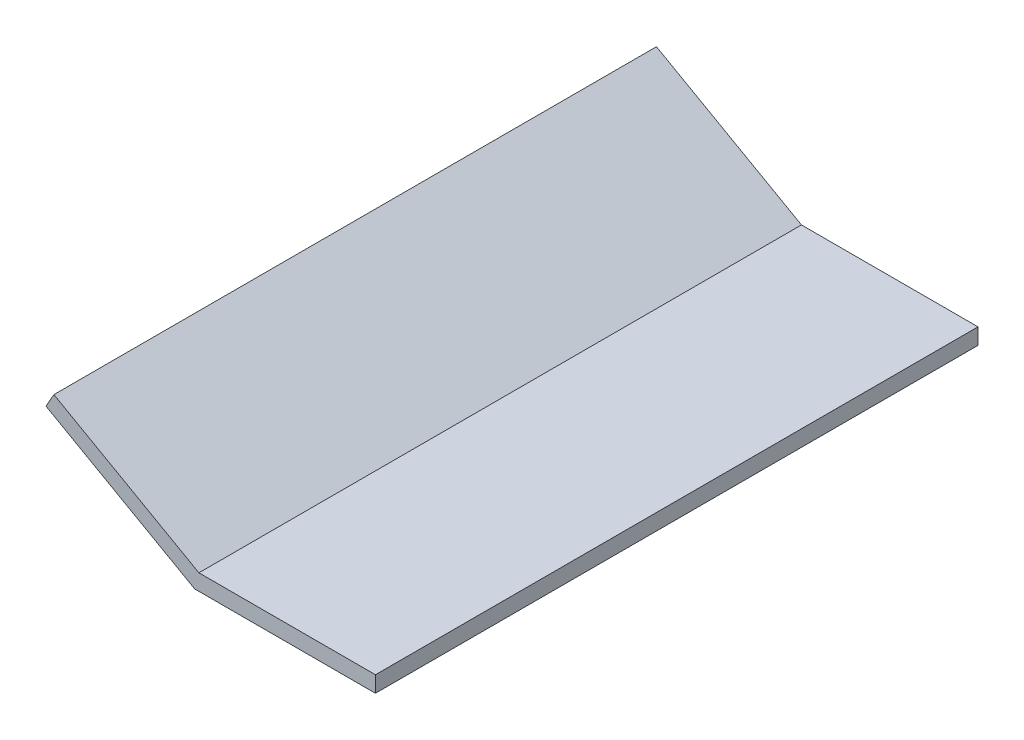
ISO-10303-21;
HEADER;
FILE_DESCRIPTION(('STEP AP214'),'2;1');
FILE_NAME('part.step','',(''),(''),'','','');
FILE_SCHEMA(('AUTOMOTIVE_DESIGN { 1 0 10303 214 1 1 1 1 }'));
ENDSEC;
DATA;
#1=APPLICATION_CONTEXT('core data for automotive mechanical design processes');
#2=APPLICATION_PROTOCOL_DEFINITION('international standard','automotive_design',2000,#1);
#3=PRODUCT_CONTEXT('',#1,'mechanical');
#4=PRODUCT('Part','Part','',(#3));
#5=PRODUCT_RELATED_PRODUCT_CATEGORY('part','',(#4));
#6=PRODUCT_DEFINITION_FORMATION('','',#4);
#7=PRODUCT_DEFINITION_CONTEXT('part definition',#1,'design');
#8=PRODUCT_DEFINITION('design','',#6,#7);
#9=PRODUCT_DEFINITION_SHAPE('','',#8);
#10=(LENGTH_UNIT() NAMED_UNIT(*) SI_UNIT(.MILLI.,.METRE.));
#11=(NAMED_UNIT(*) PLANE_ANGLE_UNIT() SI_UNIT($,.RADIAN.));
#12=(NAMED_UNIT(*) SI_UNIT($,.STERADIAN.) SOLID_ANGLE_UNIT());
#13=UNCERTAINTY_MEASURE_WITH_UNIT(LENGTH_MEASURE(1.E-05),#10,'distance_accuracy_value','');
#14=(GEOMETRIC_REPRESENTATION_CONTEXT(3) GLOBAL_UNCERTAINTY_ASSIGNED_CONTEXT((#13)) GLOBAL_UNIT_ASSIGNED_CONTEXT((#10,
#11,#12)) REPRESENTATION_CONTEXT('',''));
#15=CARTESIAN_POINT('',(0.,0.,0.));
#16=DIRECTION('',(0.,0.,1.));
#17=DIRECTION('',(1.,0.,0.));
#18=AXIS2_PLACEMENT_3D('',#15,#16,#17);
#19=CARTESIAN_POINT('',(-7.40240250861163,4.1778507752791,30.));
#20=DIRECTION('',(0.491511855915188,0.870870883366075,0.));
#21=DIRECTION('',(-0.870870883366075,0.491511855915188,0.));
#22=AXIS2_PLACEMENT_3D('',#19,#20,#21);
#23=PLANE('',#22);
#24=DIRECTION('',(0.870870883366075,-0.491511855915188,0.));
#25=VECTOR('',#24,1.);
#26=CARTESIAN_POINT('',(-7.40240250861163,4.1778507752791,0.));
#27=LINE('',#26,#25);
#28=CARTESIAN_POINT('',(-7.40240250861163,4.1778507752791,0.));
#29=VERTEX_POINT('',#28);
#30=CARTESIAN_POINT('',(0.,0.,0.));
#31=VERTEX_POINT('',#30);
#32=EDGE_CURVE('E128',#29,#31,#27,.T.);
#33=ORIENTED_EDGE('',*,*,#32,.T.);
#34=DIRECTION('',(0.,0.,-1.));
#35=VECTOR('',#34,1.);
#36=CARTESIAN_POINT('',(0.,0.,30.));
#37=LINE('',#36,#35);
#38=CARTESIAN_POINT('',(0.,0.,30.));
#39=VERTEX_POINT('',#38);
#40=EDGE_CURVE('E11',#39,#31,#37,.T.);
#41=ORIENTED_EDGE('',*,*,#40,.F.);
#42=DIRECTION('',(0.870870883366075,-0.491511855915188,0.));
#43=VECTOR('',#42,1.);
#44=CARTESIAN_POINT('',(-7.40240250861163,4.1778507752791,30.));
#45=LINE('',#44,#43);
#46=CARTESIAN_POINT('',(-7.40240250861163,4.1778507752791,30.));
#47=VERTEX_POINT('',#46);
#48=EDGE_CURVE('E144',#47,#39,#45,.T.);
#49=ORIENTED_EDGE('',*,*,#48,.F.);
#50=DIRECTION('',(0.,0.,-1.));
#51=VECTOR('',#50,1.);
#52=CARTESIAN_POINT('',(-7.40240250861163,4.1778507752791,30.));
#53=LINE('',#52,#51);
#54=EDGE_CURVE('E124',#47,#29,#53,.T.);
#55=ORIENTED_EDGE('',*,*,#54,.T.);
#56=EDGE_LOOP('',(#33,#41,#49,#55));
#57=FACE_BOUND('',#56,.T.);
#58=ADVANCED_FACE('F39',(#57),#23,.F.);
#59=CARTESIAN_POINT('',(0.,0.,30.));
#60=DIRECTION('',(0.,1.,0.));
#61=DIRECTION('',(0.,0.,1.));
#62=AXIS2_PLACEMENT_3D('',#59,#60,#61);
#63=PLANE('',#62);
#64=DIRECTION('',(1.,0.,0.));
#65=VECTOR('',#64,1.);
#66=CARTESIAN_POINT('',(0.,0.,0.));
#67=LINE('',#66,#65);
#68=CARTESIAN_POINT('',(9.,0.,0.));
#69=VERTEX_POINT('',#68);
#70=EDGE_CURVE('E132',#31,#69,#67,.T.);
#71=ORIENTED_EDGE('',*,*,#70,.T.);
#72=DIRECTION('',(0.,0.,-1.));
#73=VECTOR('',#72,1.);
#74=CARTESIAN_POINT('',(9.,0.,30.));
#75=LINE('',#74,#73);
#76=CARTESIAN_POINT('',(9.,0.,30.));
#77=VERTEX_POINT('',#76);
#78=EDGE_CURVE('E48',#77,#69,#75,.T.);
#79=ORIENTED_EDGE('',*,*,#78,.F.);
#80=DIRECTION('',(1.,0.,0.));
#81=VECTOR('',#80,1.);
#82=CARTESIAN_POINT('',(0.,0.,30.));
#83=LINE('',#82,#81);
#84=EDGE_CURVE('E93',#39,#77,#83,.T.);
#85=ORIENTED_EDGE('',*,*,#84,.F.);
#86=ORIENTED_EDGE('',*,*,#40,.T.);
#87=EDGE_LOOP('',(#71,#79,#85,#86));
#88=FACE_BOUND('',#87,.T.);
#89=ADVANCED_FACE('F172',(#88),#63,.F.);
#90=CARTESIAN_POINT('',(9.,0.,30.));
#91=DIRECTION('',(-1.,0.,0.));
#92=DIRECTION('',(0.,0.,1.));
#93=AXIS2_PLACEMENT_3D('',#90,#91,#92);
#94=PLANE('',#93);
#95=DIRECTION('',(0.,1.,0.));
#96=VECTOR('',#95,1.);
#97=CARTESIAN_POINT('',(9.,0.,0.));
#98=LINE('',#97,#96);
#99=CARTESIAN_POINT('',(9.,0.8,0.));
#100=VERTEX_POINT('',#99);
#101=EDGE_CURVE('E135',#69,#100,#98,.T.);
#102=ORIENTED_EDGE('',*,*,#101,.T.);
#103=DIRECTION('',(0.,0.,-1.));
#104=VECTOR('',#103,1.);
#105=CARTESIAN_POINT('',(9.,0.8,30.));
#106=LINE('',#105,#104);
#107=CARTESIAN_POINT('',(9.,0.8,30.));
#108=VERTEX_POINT('',#107);
#109=EDGE_CURVE('E117',#108,#100,#106,.T.);
#110=ORIENTED_EDGE('',*,*,#109,.F.);
#111=DIRECTION('',(0.,1.,0.));
#112=VECTOR('',#111,1.);
#113=CARTESIAN_POINT('',(9.,0.,30.));
#114=LINE('',#113,#112);
#115=EDGE_CURVE('E106',#77,#108,#114,.T.);
#116=ORIENTED_EDGE('',*,*,#115,.F.);
#117=ORIENTED_EDGE('',*,*,#78,.T.);
#118=EDGE_LOOP('',(#102,#110,#116,#117));
#119=FACE_BOUND('',#118,.T.);
#120=ADVANCED_FACE('F154',(#119),#94,.F.);
#121=CARTESIAN_POINT('',(9.,0.8,30.));
#122=DIRECTION('',(0.,-1.,0.));
#123=DIRECTION('',(1.,0.,0.));
#124=AXIS2_PLACEMENT_3D('',#121,#122,#123);
#125=PLANE('',#124);
#126=DIRECTION('',(-1.,0.,0.));
#127=VECTOR('',#126,1.);
#128=CARTESIAN_POINT('',(9.,0.8,0.));
#129=LINE('',#128,#127);
#130=CARTESIAN_POINT('',(0.21017457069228,0.799999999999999,0.));
#131=VERTEX_POINT('',#130);
#132=EDGE_CURVE('E115',#100,#131,#129,.T.);
#133=ORIENTED_EDGE('',*,*,#132,.T.);
#134=DIRECTION('',(0.,0.,-1.));
#135=VECTOR('',#134,1.);
#136=CARTESIAN_POINT('',(0.21017457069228,0.799999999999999,30.));
#137=LINE('',#136,#135);
#138=CARTESIAN_POINT('',(0.21017457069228,0.799999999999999,30.));
#139=VERTEX_POINT('',#138);
#140=EDGE_CURVE('E112',#139,#131,#137,.T.);
#141=ORIENTED_EDGE('',*,*,#140,.F.);
#142=DIRECTION('',(-1.,0.,0.));
#143=VECTOR('',#142,1.);
#144=CARTESIAN_POINT('',(9.,0.8,30.));
#145=LINE('',#144,#143);
#146=EDGE_CURVE('E100',#108,#139,#145,.T.);
#147=ORIENTED_EDGE('',*,*,#146,.F.);
#148=ORIENTED_EDGE('',*,*,#109,.T.);
#149=EDGE_LOOP('',(#133,#141,#147,#148));
#150=FACE_BOUND('',#149,.T.);
#151=ADVANCED_FACE('F113',(#150),#125,.F.);
#152=CARTESIAN_POINT('',(0.21017457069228,0.799999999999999,30.));
#153=DIRECTION('',(-0.491511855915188,-0.870870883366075,0.));
#154=DIRECTION('',(0.870870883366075,-0.491511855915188,0.));
#155=AXIS2_PLACEMENT_3D('',#152,#153,#154);
#156=PLANE('',#155);
#157=DIRECTION('',(-0.870870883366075,0.491511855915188,0.));
#158=VECTOR('',#157,1.);
#159=CARTESIAN_POINT('',(0.21017457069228,0.799999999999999,0.));
#160=LINE('',#159,#158);
#161=CARTESIAN_POINT('',(-7.00919302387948,4.87454748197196,0.));
#162=VERTEX_POINT('',#161);
#163=EDGE_CURVE('E79',#131,#162,#160,.T.);
#164=ORIENTED_EDGE('',*,*,#163,.T.);
#165=DIRECTION('',(0.,0.,-1.));
#166=VECTOR('',#165,1.);
#167=CARTESIAN_POINT('',(-7.00919302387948,4.87454748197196,30.));
#168=LINE('',#167,#166);
#169=CARTESIAN_POINT('',(-7.00919302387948,4.87454748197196,30.));
#170=VERTEX_POINT('',#169);
#171=EDGE_CURVE('E118',#170,#162,#168,.T.);
#172=ORIENTED_EDGE('',*,*,#171,.F.);
#173=DIRECTION('',(-0.870870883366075,0.491511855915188,0.));
#174=VECTOR('',#173,1.);
#175=CARTESIAN_POINT('',(0.21017457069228,0.799999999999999,30.));
#176=LINE('',#175,#174);
#177=EDGE_CURVE('E104',#139,#170,#176,.T.);
#178=ORIENTED_EDGE('',*,*,#177,.F.);
#179=ORIENTED_EDGE('',*,*,#140,.T.);
#180=EDGE_LOOP('',(#164,#172,#178,#179));
#181=FACE_BOUND('',#180,.T.);
#182=ADVANCED_FACE('F120',(#181),#156,.F.);
#183=CARTESIAN_POINT('',(-7.00919302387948,4.87454748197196,30.));
#184=DIRECTION('',(0.870870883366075,-0.491511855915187,0.));
#185=DIRECTION('',(0.491511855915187,0.870870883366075,0.));
#186=AXIS2_PLACEMENT_3D('',#183,#184,#185);
#187=PLANE('',#186);
#188=DIRECTION('',(-0.491511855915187,-0.870870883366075,0.));
#189=VECTOR('',#188,1.);
#190=CARTESIAN_POINT('',(-7.00919302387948,4.87454748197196,0.));
#191=LINE('',#190,#189);
#192=EDGE_CURVE('E85',#162,#29,#191,.T.);
#193=ORIENTED_EDGE('',*,*,#192,.T.);
#194=ORIENTED_EDGE('',*,*,#54,.F.);
#195=DIRECTION('',(-0.491511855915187,-0.870870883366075,0.));
#196=VECTOR('',#195,1.);
#197=CARTESIAN_POINT('',(-7.00919302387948,4.87454748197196,30.));
#198=LINE('',#197,#196);
#199=EDGE_CURVE('E56',#170,#47,#198,.T.);
#200=ORIENTED_EDGE('',*,*,#199,.F.);
#201=ORIENTED_EDGE('',*,*,#171,.T.);
#202=EDGE_LOOP('',(#193,#194,#200,#201));
#203=FACE_BOUND('',#202,.T.);
#204=ADVANCED_FACE('F161',(#203),#187,.F.);
#205=CARTESIAN_POINT('',(0.,0.,30.));
#206=DIRECTION('',(0.,0.,-1.));
#207=DIRECTION('',(-1.,0.,0.));
#208=AXIS2_PLACEMENT_3D('',#205,#206,#207);
#209=PLANE('',#208);
#210=ORIENTED_EDGE('',*,*,#48,.T.);
#211=ORIENTED_EDGE('',*,*,#84,.T.);
#212=ORIENTED_EDGE('',*,*,#115,.T.);
#213=ORIENTED_EDGE('',*,*,#146,.T.);
#214=ORIENTED_EDGE('',*,*,#177,.T.);
#215=ORIENTED_EDGE('',*,*,#199,.T.);
#216=EDGE_LOOP('',(#210,#211,#212,#213,#214,#215));
#217=FACE_BOUND('',#216,.T.);
#218=ADVANCED_FACE('F102',(#217),#209,.F.);
#219=CARTESIAN_POINT('',(0.,0.,0.));
#220=DIRECTION('',(0.,0.,-1.));
#221=DIRECTION('',(-1.,0.,0.));
#222=AXIS2_PLACEMENT_3D('',#219,#220,#221);
#223=PLANE('',#222);
#224=ORIENTED_EDGE('',*,*,#32,.F.);
#225=ORIENTED_EDGE('',*,*,#192,.F.);
#226=ORIENTED_EDGE('',*,*,#163,.F.);
#227=ORIENTED_EDGE('',*,*,#132,.F.);
#228=ORIENTED_EDGE('',*,*,#101,.F.);
#229=ORIENTED_EDGE('',*,*,#70,.F.);
#230=EDGE_LOOP('',(#224,#225,#226,#227,#228,#229));
#231=FACE_BOUND('',#230,.T.);
#232=ADVANCED_FACE('F157',(#231),#223,.T.);
#233=CLOSED_SHELL('',(#58,#89,#120,#151,#182,#204,#218,#232));
#234=MANIFOLD_SOLID_BREP('B2',#233);
#235=ADVANCED_BREP_SHAPE_REPRESENTATION('',(#18,#234),#14);
#236=SHAPE_DEFINITION_REPRESENTATION(#9,#235);
ENDSEC;
END-ISO-10303-21;
